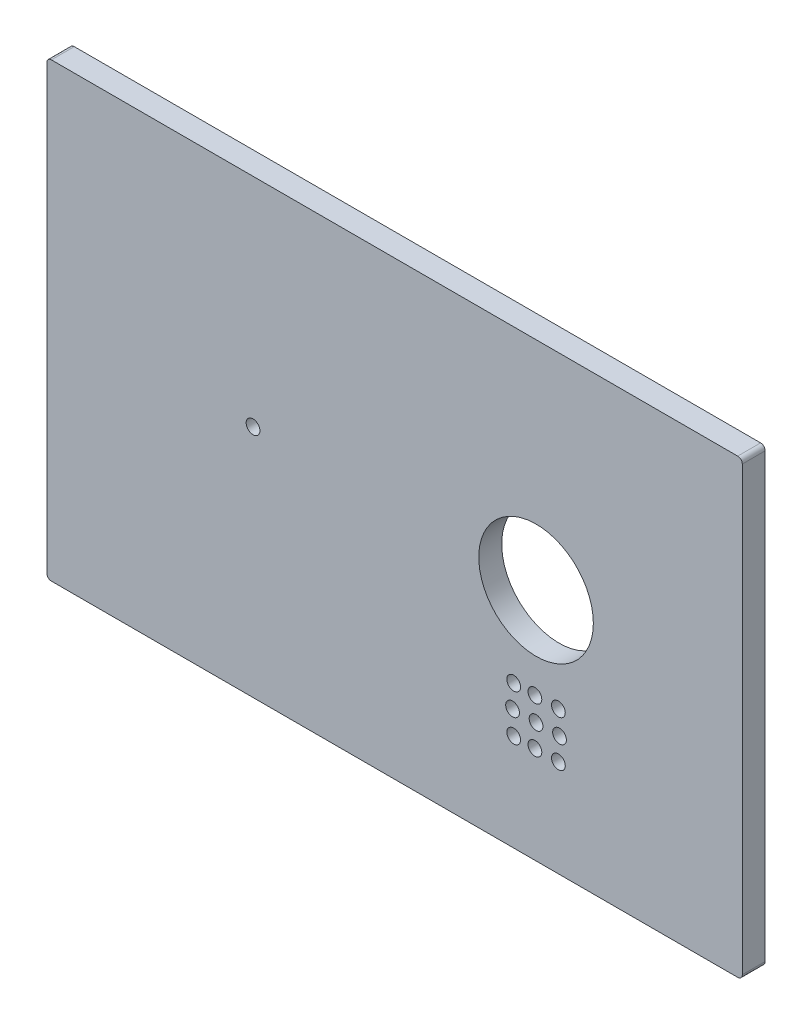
from build123d import *

# Parameters (mm, degrees)
BOSS_EXTRU_1_DEPTH      = 10
ESQUISSE2_R             = 14.1
ESQUISSE2_R_2           = 3
ENL_V_MAT_EXTRU_1_DEPTH = 273.404226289
ESQUISSE3_R             = 25
ENL_V_MAT_EXTRU_2_DEPTH = 273.404226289


with BuildPart() as part:
    # Esquisse1 → Boss.-Extru.1 (new body)
    with BuildSketch(Plane.XY):
        with BuildLine():
            Line((151.75, 74.688100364), (151.75, 190.311899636))
            Line((151.75, 190.311899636), (151.75, 224))
            ThreePointArc((151.75, 224), (151.164213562, 225.414213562), (149.75, 226))
            Line((149.75, 226), (-149.75, 226))
            ThreePointArc((-149.75, 226), (-151.164213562, 225.414213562), (-151.75, 224))
            Line((-151.75, 224), (-151.75, 190.311899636))
            Line((-151.75, 190.311899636), (-151.75, 74.688100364))
            Line((-151.75, 74.688100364), (-151.75, 31))
            ThreePointArc((-151.75, 31), (-151.164213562, 29.585786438), (-149.75, 29))
            Line((-149.75, 29), (149.75, 29))
            ThreePointArc((149.75, 29), (151.164213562, 29.585786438), (151.75, 31))
            Line((151.75, 31), (151.75, 74.688100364))
        make_face()
    extrude(amount=BOSS_EXTRU_1_DEPTH)

    # Esquisse2 → Enl_v. mat.-Extru.1 (cut, through all)
    with BuildSketch(Plane.XY.offset(10)):
        with Locations((61.75, 131.327177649)):
            Circle(ESQUISSE2_R)
        with Locations((-61.75, 131.327177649)):
            Circle(ESQUISSE2_R_2)
        with Locations((61.75, 81.327177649)):
            Circle(ESQUISSE2_R_2)
        with Locations((72, 81.327177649)):
            Circle(ESQUISSE2_R_2)
        with Locations((61.25, 91.327177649)):
            Circle(ESQUISSE2_R_2)
        with Locations((71.5, 91.327177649)):
            Circle(ESQUISSE2_R_2)
        with Locations(Location((52, 91.327177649, 0), (0, 0, 180))):
            Circle(ESQUISSE2_R_2)
        with Locations(Location((51.5, 81.327177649, 0), (0, 0, 180))):
            Circle(ESQUISSE2_R_2)
        with Locations(Location((71.5, 71.327177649, 0), (0, 0, 180))):
            Circle(ESQUISSE2_R_2)
        with Locations((52, 71.327177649)):
            Circle(ESQUISSE2_R_2)
        with Locations(Location((61.25, 71.327177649, 0), (0, 0, 180))):
            Circle(ESQUISSE2_R_2)
    extrude(amount=-ENL_V_MAT_EXTRU_1_DEPTH, mode=Mode.SUBTRACT)

    # Esquisse3 → Enl_v. mat.-Extru.2 (cut, through all)
    with BuildSketch(Plane.XY.offset(10)):
        with Locations((61.75, 131.327177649)):
            Circle(ESQUISSE3_R)
    extrude(amount=-ENL_V_MAT_EXTRU_2_DEPTH, mode=Mode.SUBTRACT)


solid = part.part
